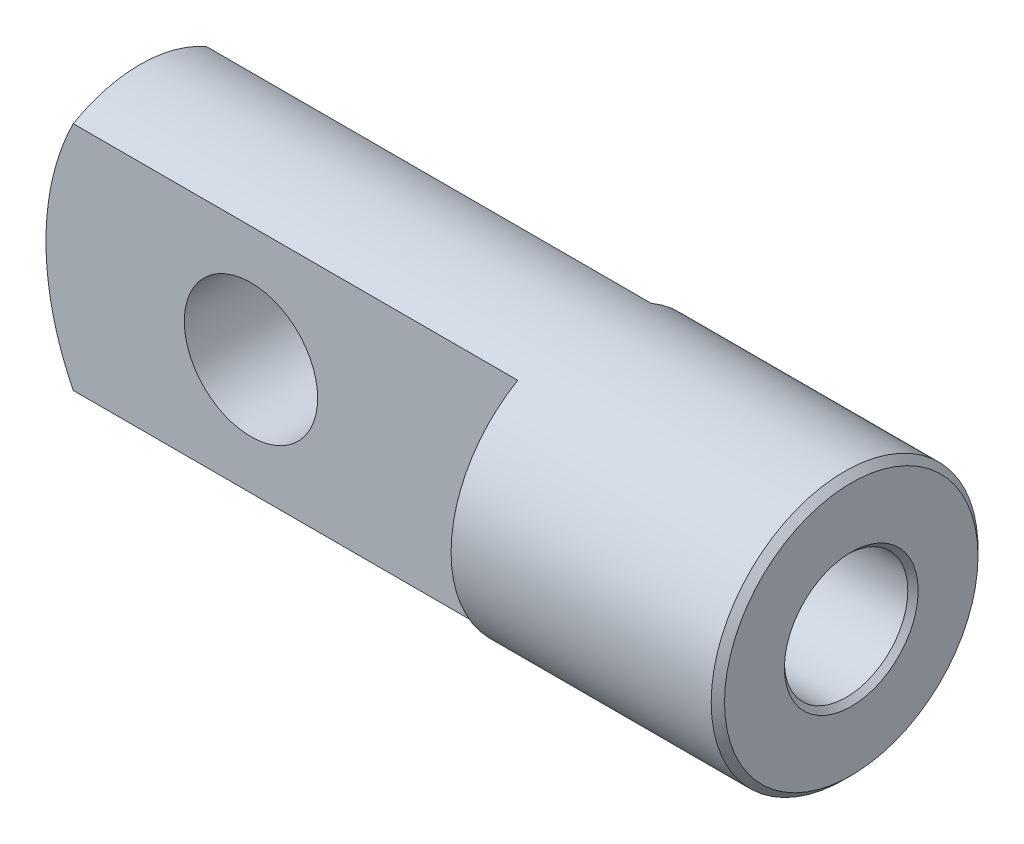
ISO-10303-21;
HEADER;
FILE_DESCRIPTION(('STEP AP214'),'2;1');
FILE_NAME('part.step','',(''),(''),'','','');
FILE_SCHEMA(('AUTOMOTIVE_DESIGN { 1 0 10303 214 1 1 1 1 }'));
ENDSEC;
DATA;
#1=APPLICATION_CONTEXT('core data for automotive mechanical design processes');
#2=APPLICATION_PROTOCOL_DEFINITION('international standard','automotive_design',2000,#1);
#3=PRODUCT_CONTEXT('',#1,'mechanical');
#4=PRODUCT('Part','Part','',(#3));
#5=PRODUCT_RELATED_PRODUCT_CATEGORY('part','',(#4));
#6=PRODUCT_DEFINITION_FORMATION('','',#4);
#7=PRODUCT_DEFINITION_CONTEXT('part definition',#1,'design');
#8=PRODUCT_DEFINITION('design','',#6,#7);
#9=PRODUCT_DEFINITION_SHAPE('','',#8);
#10=(LENGTH_UNIT() NAMED_UNIT(*) SI_UNIT(.MILLI.,.METRE.));
#11=(NAMED_UNIT(*) PLANE_ANGLE_UNIT() SI_UNIT($,.RADIAN.));
#12=(NAMED_UNIT(*) SI_UNIT($,.STERADIAN.) SOLID_ANGLE_UNIT());
#13=UNCERTAINTY_MEASURE_WITH_UNIT(LENGTH_MEASURE(1.E-05),#10,'distance_accuracy_value','');
#14=(GEOMETRIC_REPRESENTATION_CONTEXT(3) GLOBAL_UNCERTAINTY_ASSIGNED_CONTEXT((#13)) GLOBAL_UNIT_ASSIGNED_CONTEXT((#10,
#11,#12)) REPRESENTATION_CONTEXT('',''));
#15=CARTESIAN_POINT('',(0.,0.,0.));
#16=DIRECTION('',(0.,0.,1.));
#17=DIRECTION('',(1.,0.,0.));
#18=AXIS2_PLACEMENT_3D('',#15,#16,#17);
#19=CARTESIAN_POINT('',(-72.,0.,0.));
#20=DIRECTION('',(-1.,0.,0.));
#21=DIRECTION('',(0.,1.,0.));
#22=AXIS2_PLACEMENT_3D('',#19,#20,#21);
#23=SPHERICAL_SURFACE('',#22,40.);
#24=CARTESIAN_POINT('',(-112.,0.,0.));
#25=VERTEX_POINT('',#24);
#26=VERTEX_LOOP('',#25);
#27=FACE_BOUND('',#26,.T.);
#28=CARTESIAN_POINT('',(-106.641016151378,0.,0.));
#29=DIRECTION('',(-1.,0.,0.));
#30=DIRECTION('',(0.,0.,1.));
#31=AXIS2_PLACEMENT_3D('',#28,#29,#30);
#32=CIRCLE('',#31,20.);
#33=CARTESIAN_POINT('',(-106.641016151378,17.3205080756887,10.));
#34=VERTEX_POINT('',#33);
#35=CARTESIAN_POINT('',(-106.641016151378,17.3205080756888,-9.99999999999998));
#36=VERTEX_POINT('',#35);
#37=EDGE_CURVE('E120',#34,#36,#32,.T.);
#38=ORIENTED_EDGE('',*,*,#37,.T.);
#39=CARTESIAN_POINT('',(-72.,0.,-9.99999999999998));
#40=DIRECTION('',(0.,0.,1.));
#41=DIRECTION('',(1.,0.,0.));
#42=AXIS2_PLACEMENT_3D('',#39,#40,#41);
#43=CIRCLE('',#42,38.7298334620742);
#44=CARTESIAN_POINT('',(-106.641016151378,-17.3205080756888,-9.99999999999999));
#45=VERTEX_POINT('',#44);
#46=EDGE_CURVE('E110',#36,#45,#43,.T.);
#47=ORIENTED_EDGE('',*,*,#46,.T.);
#48=CARTESIAN_POINT('',(-106.641016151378,-17.3205080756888,10.));
#49=VERTEX_POINT('',#48);
#50=EDGE_CURVE('E119',#45,#49,#32,.T.);
#51=ORIENTED_EDGE('',*,*,#50,.T.);
#52=CARTESIAN_POINT('',(-72.,0.,10.));
#53=DIRECTION('',(0.,0.,-1.));
#54=DIRECTION('',(-1.,0.,0.));
#55=AXIS2_PLACEMENT_3D('',#52,#53,#54);
#56=CIRCLE('',#55,38.7298334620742);
#57=EDGE_CURVE('E105',#49,#34,#56,.T.);
#58=ORIENTED_EDGE('',*,*,#57,.T.);
#59=EDGE_LOOP('',(#38,#47,#51,#58));
#60=FACE_BOUND('',#59,.T.);
#61=ADVANCED_FACE('F42',(#27,#60),#23,.T.);
#62=CARTESIAN_POINT('',(-112.,0.,0.));
#63=DIRECTION('',(-1.,0.,0.));
#64=DIRECTION('',(0.,0.,1.));
#65=AXIS2_PLACEMENT_3D('',#62,#63,#64);
#66=CYLINDRICAL_SURFACE('',#65,20.);
#67=CARTESIAN_POINT('',(-40.,0.,0.));
#68=DIRECTION('',(1.,0.,0.));
#69=DIRECTION('',(0.,0.,-1.));
#70=AXIS2_PLACEMENT_3D('',#67,#68,#69);
#71=CIRCLE('',#70,20.);
#72=CARTESIAN_POINT('',(-40.,-17.3205080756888,-9.99999999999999));
#73=VERTEX_POINT('',#72);
#74=CARTESIAN_POINT('',(-40.,17.3205080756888,-9.99999999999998));
#75=VERTEX_POINT('',#74);
#76=EDGE_CURVE('E50',#73,#75,#71,.T.);
#77=ORIENTED_EDGE('',*,*,#76,.T.);
#78=DIRECTION('',(-1.,0.,0.));
#79=VECTOR('',#78,1.);
#80=CARTESIAN_POINT('',(-112.,17.3205080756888,-9.99999999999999));
#81=LINE('',#80,#79);
#82=EDGE_CURVE('E12',#75,#36,#81,.T.);
#83=ORIENTED_EDGE('',*,*,#82,.T.);
#84=ORIENTED_EDGE('',*,*,#37,.F.);
#85=DIRECTION('',(-1.,0.,0.));
#86=VECTOR('',#85,1.);
#87=CARTESIAN_POINT('',(-112.,17.3205080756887,10.));
#88=LINE('',#87,#86);
#89=CARTESIAN_POINT('',(-40.,17.3205080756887,10.));
#90=VERTEX_POINT('',#89);
#91=EDGE_CURVE('E123',#34,#90,#88,.F.);
#92=ORIENTED_EDGE('',*,*,#91,.T.);
#93=CARTESIAN_POINT('',(-40.,0.,0.));
#94=DIRECTION('',(1.,0.,0.));
#95=DIRECTION('',(0.,0.,-1.));
#96=AXIS2_PLACEMENT_3D('',#93,#94,#95);
#97=CIRCLE('',#96,20.);
#98=CARTESIAN_POINT('',(-40.,-17.3205080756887,9.99999999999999));
#99=VERTEX_POINT('',#98);
#100=EDGE_CURVE('E126',#90,#99,#97,.T.);
#101=ORIENTED_EDGE('',*,*,#100,.T.);
#102=DIRECTION('',(-1.,0.,0.));
#103=VECTOR('',#102,1.);
#104=CARTESIAN_POINT('',(-112.,-17.3205080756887,10.));
#105=LINE('',#104,#103);
#106=EDGE_CURVE('E129',#99,#49,#105,.T.);
#107=ORIENTED_EDGE('',*,*,#106,.T.);
#108=ORIENTED_EDGE('',*,*,#50,.F.);
#109=DIRECTION('',(-1.,0.,0.));
#110=VECTOR('',#109,1.);
#111=CARTESIAN_POINT('',(-112.,-17.3205080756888,-9.99999999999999));
#112=LINE('',#111,#110);
#113=EDGE_CURVE('E132',#45,#73,#112,.F.);
#114=ORIENTED_EDGE('',*,*,#113,.T.);
#115=EDGE_LOOP('',(#77,#83,#84,#92,#101,#107,#108,#114));
#116=FACE_BOUND('',#115,.T.);
#117=CARTESIAN_POINT('',(-1.,0.,0.));
#118=DIRECTION('',(-1.,0.,0.));
#119=DIRECTION('',(0.,0.,1.));
#120=AXIS2_PLACEMENT_3D('',#117,#118,#119);
#121=CIRCLE('',#120,20.);
#122=CARTESIAN_POINT('',(-1.,0.,20.));
#123=VERTEX_POINT('',#122);
#124=EDGE_CURVE('E116',#123,#123,#121,.T.);
#125=ORIENTED_EDGE('',*,*,#124,.T.);
#126=EDGE_LOOP('',(#125));
#127=FACE_BOUND('',#126,.T.);
#128=ADVANCED_FACE('F137',(#116,#127),#66,.T.);
#129=CARTESIAN_POINT('',(0.,0.,0.));
#130=DIRECTION('',(-1.,0.,0.));
#131=DIRECTION('',(0.,0.,1.));
#132=AXIS2_PLACEMENT_3D('',#129,#130,#131);
#133=CONICAL_SURFACE('',#132,19.,0.785398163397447);
#134=ORIENTED_EDGE('',*,*,#124,.F.);
#135=EDGE_LOOP('',(#134));
#136=FACE_BOUND('',#135,.T.);
#137=CARTESIAN_POINT('',(0.,0.,0.));
#138=DIRECTION('',(-1.,0.,0.));
#139=DIRECTION('',(0.,0.,1.));
#140=AXIS2_PLACEMENT_3D('',#137,#138,#139);
#141=CIRCLE('',#140,19.);
#142=CARTESIAN_POINT('',(0.,0.,19.));
#143=VERTEX_POINT('',#142);
#144=EDGE_CURVE('E113',#143,#143,#141,.T.);
#145=ORIENTED_EDGE('',*,*,#144,.T.);
#146=EDGE_LOOP('',(#145));
#147=FACE_BOUND('',#146,.T.);
#148=ADVANCED_FACE('F161',(#136,#147),#133,.T.);
#149=CARTESIAN_POINT('',(0.,0.,0.));
#150=DIRECTION('',(-1.,0.,0.));
#151=DIRECTION('',(0.,0.,1.));
#152=AXIS2_PLACEMENT_3D('',#149,#150,#151);
#153=PLANE('',#152);
#154=CARTESIAN_POINT('',(0.,0.,0.));
#155=DIRECTION('',(1.,0.,0.));
#156=DIRECTION('',(0.,0.,-1.));
#157=AXIS2_PLACEMENT_3D('',#154,#155,#156);
#158=CIRCLE('',#157,10.025);
#159=CARTESIAN_POINT('',(0.,0.,-10.025));
#160=VERTEX_POINT('',#159);
#161=EDGE_CURVE('E100',#160,#160,#158,.T.);
#162=ORIENTED_EDGE('',*,*,#161,.F.);
#163=EDGE_LOOP('',(#162));
#164=FACE_BOUND('',#163,.T.);
#165=ORIENTED_EDGE('',*,*,#144,.F.);
#166=EDGE_LOOP('',(#165));
#167=FACE_BOUND('',#166,.T.);
#168=ADVANCED_FACE('F168',(#164,#167),#153,.F.);
#169=CARTESIAN_POINT('',(-112.,-30.,10.));
#170=DIRECTION('',(0.,0.,-1.));
#171=DIRECTION('',(-1.,0.,0.));
#172=AXIS2_PLACEMENT_3D('',#169,#170,#171);
#173=PLANE('',#172);
#174=CARTESIAN_POINT('',(-80.,0.,9.99999999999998));
#175=DIRECTION('',(0.,0.,1.));
#176=DIRECTION('',(1.,0.,0.));
#177=AXIS2_PLACEMENT_3D('',#174,#175,#176);
#178=CIRCLE('',#177,9.99999999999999);
#179=CARTESIAN_POINT('',(-70.,0.,9.99999999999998));
#180=VERTEX_POINT('',#179);
#181=EDGE_CURVE('E94',#180,#180,#178,.T.);
#182=ORIENTED_EDGE('',*,*,#181,.F.);
#183=EDGE_LOOP('',(#182));
#184=FACE_BOUND('',#183,.T.);
#185=DIRECTION('',(0.,1.,0.));
#186=VECTOR('',#185,1.);
#187=CARTESIAN_POINT('',(-40.,-30.,9.99999999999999));
#188=LINE('',#187,#186);
#189=EDGE_CURVE('E106',#99,#90,#188,.T.);
#190=ORIENTED_EDGE('',*,*,#189,.T.);
#191=ORIENTED_EDGE('',*,*,#91,.F.);
#192=ORIENTED_EDGE('',*,*,#57,.F.);
#193=ORIENTED_EDGE('',*,*,#106,.F.);
#194=EDGE_LOOP('',(#190,#191,#192,#193));
#195=FACE_BOUND('',#194,.T.);
#196=ADVANCED_FACE('F153',(#184,#195),#173,.F.);
#197=CARTESIAN_POINT('',(-40.,-30.,9.99999999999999));
#198=DIRECTION('',(1.,0.,0.));
#199=DIRECTION('',(0.,0.,-1.));
#200=AXIS2_PLACEMENT_3D('',#197,#198,#199);
#201=PLANE('',#200);
#202=ORIENTED_EDGE('',*,*,#189,.F.);
#203=ORIENTED_EDGE('',*,*,#100,.F.);
#204=EDGE_LOOP('',(#202,#203));
#205=FACE_BOUND('',#204,.T.);
#206=ADVANCED_FACE('F145',(#205),#201,.F.);
#207=CARTESIAN_POINT('',(-40.,-30.,-9.99999999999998));
#208=DIRECTION('',(1.,0.,0.));
#209=DIRECTION('',(0.,0.,-1.));
#210=AXIS2_PLACEMENT_3D('',#207,#208,#209);
#211=PLANE('',#210);
#212=DIRECTION('',(0.,1.,0.));
#213=VECTOR('',#212,1.);
#214=CARTESIAN_POINT('',(-40.,-30.,-9.99999999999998));
#215=LINE('',#214,#213);
#216=EDGE_CURVE('E60',#73,#75,#215,.T.);
#217=ORIENTED_EDGE('',*,*,#216,.T.);
#218=ORIENTED_EDGE('',*,*,#76,.F.);
#219=EDGE_LOOP('',(#217,#218));
#220=FACE_BOUND('',#219,.T.);
#221=ADVANCED_FACE('F142',(#220),#211,.F.);
#222=CARTESIAN_POINT('',(-112.,-30.,-9.99999999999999));
#223=DIRECTION('',(0.,0.,1.));
#224=DIRECTION('',(1.,0.,0.));
#225=AXIS2_PLACEMENT_3D('',#222,#223,#224);
#226=PLANE('',#225);
#227=CARTESIAN_POINT('',(-80.,0.,-9.99999999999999));
#228=DIRECTION('',(0.,0.,1.));
#229=DIRECTION('',(1.,0.,0.));
#230=AXIS2_PLACEMENT_3D('',#227,#228,#229);
#231=CIRCLE('',#230,9.99999999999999);
#232=CARTESIAN_POINT('',(-70.,0.,-9.99999999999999));
#233=VERTEX_POINT('',#232);
#234=EDGE_CURVE('E45',#233,#233,#231,.T.);
#235=ORIENTED_EDGE('',*,*,#234,.T.);
#236=EDGE_LOOP('',(#235));
#237=FACE_BOUND('',#236,.T.);
#238=ORIENTED_EDGE('',*,*,#216,.F.);
#239=ORIENTED_EDGE('',*,*,#113,.F.);
#240=ORIENTED_EDGE('',*,*,#46,.F.);
#241=ORIENTED_EDGE('',*,*,#82,.F.);
#242=EDGE_LOOP('',(#238,#239,#240,#241));
#243=FACE_BOUND('',#242,.T.);
#244=ADVANCED_FACE('F144',(#237,#243),#226,.F.);
#245=CARTESIAN_POINT('',(-80.,0.,-20.));
#246=DIRECTION('',(0.,0.,1.));
#247=DIRECTION('',(1.,0.,0.));
#248=AXIS2_PLACEMENT_3D('',#245,#246,#247);
#249=CYLINDRICAL_SURFACE('',#248,9.99999999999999);
#250=ORIENTED_EDGE('',*,*,#181,.T.);
#251=EDGE_LOOP('',(#250));
#252=FACE_BOUND('',#251,.T.);
#253=ORIENTED_EDGE('',*,*,#234,.F.);
#254=EDGE_LOOP('',(#253));
#255=FACE_BOUND('',#254,.T.);
#256=ADVANCED_FACE('F88',(#252,#255),#249,.F.);
#257=CARTESIAN_POINT('',(-35.5,0.,0.));
#258=DIRECTION('',(1.,0.,0.));
#259=DIRECTION('',(0.,0.,-1.));
#260=AXIS2_PLACEMENT_3D('',#257,#258,#259);
#261=CONICAL_SURFACE('',#260,9.24999999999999,1.02974425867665);
#262=CARTESIAN_POINT('',(-41.0579607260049,0.,0.));
#263=VERTEX_POINT('',#262);
#264=VERTEX_LOOP('',#263);
#265=FACE_BOUND('',#264,.T.);
#266=CARTESIAN_POINT('',(-35.5,0.,0.));
#267=DIRECTION('',(1.,0.,0.));
#268=DIRECTION('',(0.,0.,-1.));
#269=AXIS2_PLACEMENT_3D('',#266,#267,#268);
#270=CIRCLE('',#269,9.24999999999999);
#271=CARTESIAN_POINT('',(-35.5,0.,-9.24999999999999));
#272=VERTEX_POINT('',#271);
#273=EDGE_CURVE('E92',#272,#272,#270,.T.);
#274=ORIENTED_EDGE('',*,*,#273,.T.);
#275=EDGE_LOOP('',(#274));
#276=FACE_BOUND('',#275,.T.);
#277=ADVANCED_FACE('F84',(#265,#276),#261,.F.);
#278=CARTESIAN_POINT('',(0.,0.,0.));
#279=DIRECTION('',(1.,0.,0.));
#280=DIRECTION('',(0.,0.,-1.));
#281=AXIS2_PLACEMENT_3D('',#278,#279,#280);
#282=CYLINDRICAL_SURFACE('',#281,9.24999999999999);
#283=ORIENTED_EDGE('',*,*,#273,.F.);
#284=EDGE_LOOP('',(#283));
#285=FACE_BOUND('',#284,.T.);
#286=CARTESIAN_POINT('',(-0.774999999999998,0.,0.));
#287=DIRECTION('',(1.,0.,0.));
#288=DIRECTION('',(0.,0.,-1.));
#289=AXIS2_PLACEMENT_3D('',#286,#287,#288);
#290=CIRCLE('',#289,9.24999999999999);
#291=CARTESIAN_POINT('',(-0.774999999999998,0.,-9.24999999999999));
#292=VERTEX_POINT('',#291);
#293=EDGE_CURVE('E95',#292,#292,#290,.T.);
#294=ORIENTED_EDGE('',*,*,#293,.T.);
#295=EDGE_LOOP('',(#294));
#296=FACE_BOUND('',#295,.T.);
#297=ADVANCED_FACE('F87',(#285,#296),#282,.F.);
#298=CARTESIAN_POINT('',(0.,0.,0.));
#299=DIRECTION('',(1.,0.,0.));
#300=DIRECTION('',(0.,0.,-1.));
#301=AXIS2_PLACEMENT_3D('',#298,#299,#300);
#302=CONICAL_SURFACE('',#301,10.025,0.785398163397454);
#303=ORIENTED_EDGE('',*,*,#293,.F.);
#304=EDGE_LOOP('',(#303));
#305=FACE_BOUND('',#304,.T.);
#306=ORIENTED_EDGE('',*,*,#161,.T.);
#307=EDGE_LOOP('',(#306));
#308=FACE_BOUND('',#307,.T.);
#309=ADVANCED_FACE('F214',(#305,#308),#302,.F.);
#310=CLOSED_SHELL('',(#61,#128,#148,#168,#196,#206,#221,#244,#256,#277,#297,#309));
#311=MANIFOLD_SOLID_BREP('B2',#310);
#312=ADVANCED_BREP_SHAPE_REPRESENTATION('',(#18,#311),#14);
#313=SHAPE_DEFINITION_REPRESENTATION(#9,#312);
ENDSEC;
END-ISO-10303-21;
